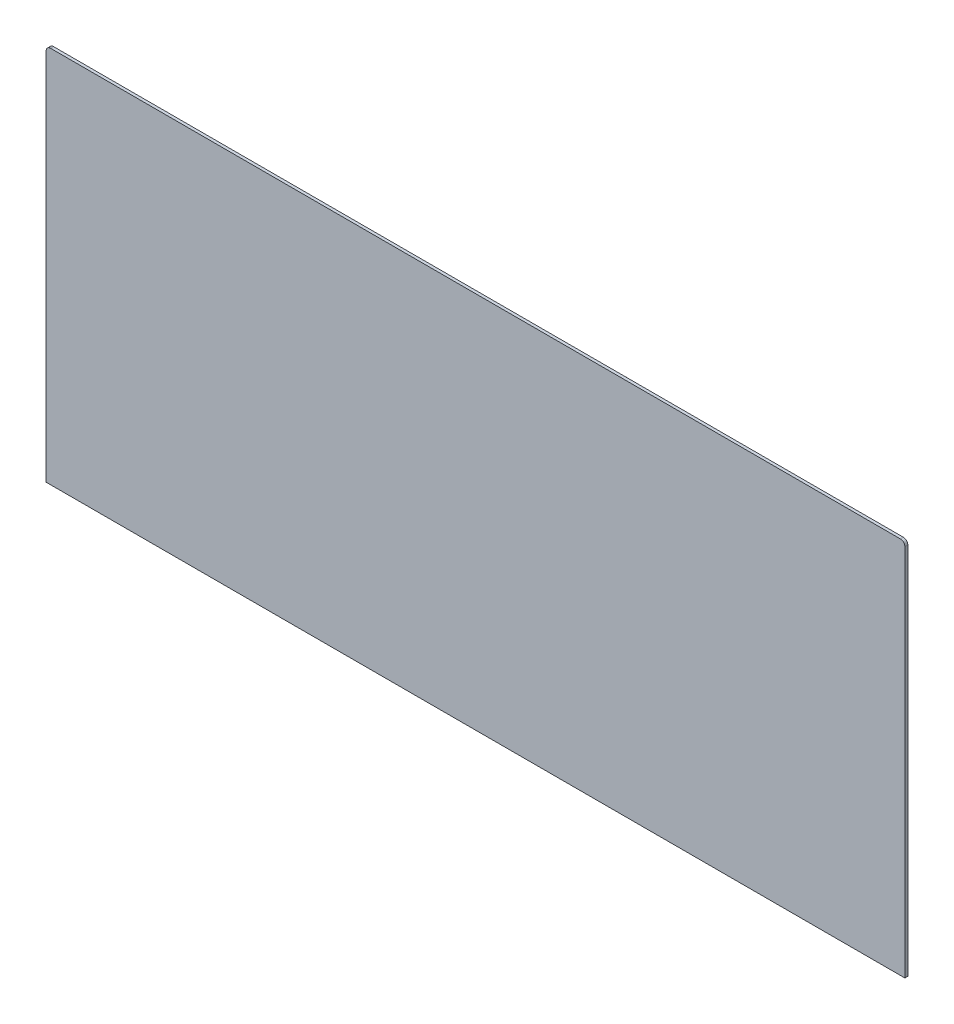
ISO-10303-21;
HEADER;
FILE_DESCRIPTION(('STEP AP214'),'2;1');
FILE_NAME('part.step','',(''),(''),'','','');
FILE_SCHEMA(('AUTOMOTIVE_DESIGN { 1 0 10303 214 1 1 1 1 }'));
ENDSEC;
DATA;
#1=APPLICATION_CONTEXT('core data for automotive mechanical design processes');
#2=APPLICATION_PROTOCOL_DEFINITION('international standard','automotive_design',2000,#1);
#3=PRODUCT_CONTEXT('',#1,'mechanical');
#4=PRODUCT('Part','Part','',(#3));
#5=PRODUCT_RELATED_PRODUCT_CATEGORY('part','',(#4));
#6=PRODUCT_DEFINITION_FORMATION('','',#4);
#7=PRODUCT_DEFINITION_CONTEXT('part definition',#1,'design');
#8=PRODUCT_DEFINITION('design','',#6,#7);
#9=PRODUCT_DEFINITION_SHAPE('','',#8);
#10=(LENGTH_UNIT() NAMED_UNIT(*) SI_UNIT(.MILLI.,.METRE.));
#11=(NAMED_UNIT(*) PLANE_ANGLE_UNIT() SI_UNIT($,.RADIAN.));
#12=(NAMED_UNIT(*) SI_UNIT($,.STERADIAN.) SOLID_ANGLE_UNIT());
#13=UNCERTAINTY_MEASURE_WITH_UNIT(LENGTH_MEASURE(1.E-05),#10,'distance_accuracy_value','');
#14=(GEOMETRIC_REPRESENTATION_CONTEXT(3) GLOBAL_UNCERTAINTY_ASSIGNED_CONTEXT((#13)) GLOBAL_UNIT_ASSIGNED_CONTEXT((#10,
#11,#12)) REPRESENTATION_CONTEXT('',''));
#15=CARTESIAN_POINT('',(0.,0.,0.));
#16=DIRECTION('',(0.,0.,1.));
#17=DIRECTION('',(1.,0.,0.));
#18=AXIS2_PLACEMENT_3D('',#15,#16,#17);
#19=CARTESIAN_POINT('',(0.,128.79374203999,2.));
#20=DIRECTION('',(0.,0.,1.));
#21=DIRECTION('',(1.,0.,0.));
#22=AXIS2_PLACEMENT_3D('',#19,#20,#21);
#23=PLANE('',#22);
#24=DIRECTION('',(1.,0.,0.));
#25=VECTOR('',#24,1.);
#26=CARTESIAN_POINT('',(-293.,0.,2.));
#27=LINE('',#26,#25);
#28=CARTESIAN_POINT('',(-293.,0.,2.));
#29=VERTEX_POINT('',#28);
#30=CARTESIAN_POINT('',(293.,0.,2.));
#31=VERTEX_POINT('',#30);
#32=EDGE_CURVE('E138',#29,#31,#27,.T.);
#33=ORIENTED_EDGE('',*,*,#32,.T.);
#34=DIRECTION('',(0.,1.,0.));
#35=VECTOR('',#34,1.);
#36=CARTESIAN_POINT('',(293.,0.,2.));
#37=LINE('',#36,#35);
#38=CARTESIAN_POINT('',(293.,255.,2.));
#39=VERTEX_POINT('',#38);
#40=EDGE_CURVE('E113',#31,#39,#37,.T.);
#41=ORIENTED_EDGE('',*,*,#40,.T.);
#42=CARTESIAN_POINT('',(290.,255.,2.));
#43=DIRECTION('',(0.,0.,1.));
#44=DIRECTION('',(1.,0.,0.));
#45=AXIS2_PLACEMENT_3D('',#42,#43,#44);
#46=CIRCLE('',#45,3.);
#47=CARTESIAN_POINT('',(290.,258.,2.));
#48=VERTEX_POINT('',#47);
#49=EDGE_CURVE('E103',#39,#48,#46,.T.);
#50=ORIENTED_EDGE('',*,*,#49,.T.);
#51=DIRECTION('',(-1.,0.,0.));
#52=VECTOR('',#51,1.);
#53=CARTESIAN_POINT('',(290.,258.,2.));
#54=LINE('',#53,#52);
#55=CARTESIAN_POINT('',(-290.,258.,2.));
#56=VERTEX_POINT('',#55);
#57=EDGE_CURVE('E88',#48,#56,#54,.T.);
#58=ORIENTED_EDGE('',*,*,#57,.T.);
#59=CARTESIAN_POINT('',(-290.,255.,2.));
#60=DIRECTION('',(0.,0.,1.));
#61=DIRECTION('',(1.,0.,0.));
#62=AXIS2_PLACEMENT_3D('',#59,#60,#61);
#63=CIRCLE('',#62,3.);
#64=CARTESIAN_POINT('',(-293.,255.,2.));
#65=VERTEX_POINT('',#64);
#66=EDGE_CURVE('E93',#56,#65,#63,.T.);
#67=ORIENTED_EDGE('',*,*,#66,.T.);
#68=DIRECTION('',(0.,-1.,0.));
#69=VECTOR('',#68,1.);
#70=CARTESIAN_POINT('',(-293.,255.,2.));
#71=LINE('',#70,#69);
#72=EDGE_CURVE('E10',#65,#29,#71,.T.);
#73=ORIENTED_EDGE('',*,*,#72,.T.);
#74=EDGE_LOOP('',(#33,#41,#50,#58,#67,#73));
#75=FACE_BOUND('',#74,.T.);
#76=ADVANCED_FACE('F16',(#75),#23,.T.);
#77=CARTESIAN_POINT('',(0.,128.79374203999,0.));
#78=DIRECTION('',(0.,0.,1.));
#79=DIRECTION('',(1.,0.,0.));
#80=AXIS2_PLACEMENT_3D('',#77,#78,#79);
#81=PLANE('',#80);
#82=DIRECTION('',(0.,-1.,0.));
#83=VECTOR('',#82,1.);
#84=CARTESIAN_POINT('',(-293.,255.,0.));
#85=LINE('',#84,#83);
#86=CARTESIAN_POINT('',(-293.,255.,0.));
#87=VERTEX_POINT('',#86);
#88=CARTESIAN_POINT('',(-293.,0.,0.));
#89=VERTEX_POINT('',#88);
#90=EDGE_CURVE('E24',#87,#89,#85,.T.);
#91=ORIENTED_EDGE('',*,*,#90,.F.);
#92=CARTESIAN_POINT('',(-290.,255.,0.));
#93=DIRECTION('',(0.,0.,1.));
#94=DIRECTION('',(1.,0.,0.));
#95=AXIS2_PLACEMENT_3D('',#92,#93,#94);
#96=CIRCLE('',#95,3.);
#97=CARTESIAN_POINT('',(-290.,258.,0.));
#98=VERTEX_POINT('',#97);
#99=EDGE_CURVE('E78',#98,#87,#96,.T.);
#100=ORIENTED_EDGE('',*,*,#99,.F.);
#101=DIRECTION('',(-1.,0.,0.));
#102=VECTOR('',#101,1.);
#103=CARTESIAN_POINT('',(290.,258.,0.));
#104=LINE('',#103,#102);
#105=CARTESIAN_POINT('',(290.,258.,0.));
#106=VERTEX_POINT('',#105);
#107=EDGE_CURVE('E82',#106,#98,#104,.T.);
#108=ORIENTED_EDGE('',*,*,#107,.F.);
#109=CARTESIAN_POINT('',(290.,255.,0.));
#110=DIRECTION('',(0.,0.,1.));
#111=DIRECTION('',(1.,0.,0.));
#112=AXIS2_PLACEMENT_3D('',#109,#110,#111);
#113=CIRCLE('',#112,3.);
#114=CARTESIAN_POINT('',(293.,255.,0.));
#115=VERTEX_POINT('',#114);
#116=EDGE_CURVE('E115',#115,#106,#113,.T.);
#117=ORIENTED_EDGE('',*,*,#116,.F.);
#118=DIRECTION('',(0.,1.,0.));
#119=VECTOR('',#118,1.);
#120=CARTESIAN_POINT('',(293.,0.,0.));
#121=LINE('',#120,#119);
#122=CARTESIAN_POINT('',(293.,0.,0.));
#123=VERTEX_POINT('',#122);
#124=EDGE_CURVE('E140',#123,#115,#121,.T.);
#125=ORIENTED_EDGE('',*,*,#124,.F.);
#126=DIRECTION('',(1.,0.,0.));
#127=VECTOR('',#126,1.);
#128=CARTESIAN_POINT('',(-293.,0.,0.));
#129=LINE('',#128,#127);
#130=EDGE_CURVE('E136',#89,#123,#129,.T.);
#131=ORIENTED_EDGE('',*,*,#130,.F.);
#132=EDGE_LOOP('',(#91,#100,#108,#117,#125,#131));
#133=FACE_BOUND('',#132,.T.);
#134=ADVANCED_FACE('F80',(#133),#81,.F.);
#135=CARTESIAN_POINT('',(-293.,255.,0.));
#136=DIRECTION('',(1.,0.,0.));
#137=DIRECTION('',(0.,1.,0.));
#138=AXIS2_PLACEMENT_3D('',#135,#136,#137);
#139=PLANE('',#138);
#140=ORIENTED_EDGE('',*,*,#90,.T.);
#141=DIRECTION('',(0.,0.,1.));
#142=VECTOR('',#141,1.);
#143=CARTESIAN_POINT('',(-293.,0.,0.));
#144=LINE('',#143,#142);
#145=EDGE_CURVE('E127',#89,#29,#144,.T.);
#146=ORIENTED_EDGE('',*,*,#145,.T.);
#147=ORIENTED_EDGE('',*,*,#72,.F.);
#148=DIRECTION('',(0.,0.,1.));
#149=VECTOR('',#148,1.);
#150=CARTESIAN_POINT('',(-293.,255.,0.));
#151=LINE('',#150,#149);
#152=EDGE_CURVE('E87',#87,#65,#151,.T.);
#153=ORIENTED_EDGE('',*,*,#152,.F.);
#154=EDGE_LOOP('',(#140,#146,#147,#153));
#155=FACE_BOUND('',#154,.T.);
#156=ADVANCED_FACE('F124',(#155),#139,.F.);
#157=CARTESIAN_POINT('',(-290.,255.,0.));
#158=DIRECTION('',(0.,0.,-1.));
#159=DIRECTION('',(1.,0.,0.));
#160=AXIS2_PLACEMENT_3D('',#157,#158,#159);
#161=CYLINDRICAL_SURFACE('',#160,3.);
#162=ORIENTED_EDGE('',*,*,#99,.T.);
#163=ORIENTED_EDGE('',*,*,#152,.T.);
#164=ORIENTED_EDGE('',*,*,#66,.F.);
#165=DIRECTION('',(0.,0.,1.));
#166=VECTOR('',#165,1.);
#167=CARTESIAN_POINT('',(-290.,258.,0.));
#168=LINE('',#167,#166);
#169=EDGE_CURVE('E91',#98,#56,#168,.T.);
#170=ORIENTED_EDGE('',*,*,#169,.F.);
#171=EDGE_LOOP('',(#162,#163,#164,#170));
#172=FACE_BOUND('',#171,.T.);
#173=ADVANCED_FACE('F92',(#172),#161,.T.);
#174=CARTESIAN_POINT('',(290.,258.,0.));
#175=DIRECTION('',(0.,-1.,0.));
#176=DIRECTION('',(0.,0.,-1.));
#177=AXIS2_PLACEMENT_3D('',#174,#175,#176);
#178=PLANE('',#177);
#179=ORIENTED_EDGE('',*,*,#107,.T.);
#180=ORIENTED_EDGE('',*,*,#169,.T.);
#181=ORIENTED_EDGE('',*,*,#57,.F.);
#182=DIRECTION('',(0.,0.,1.));
#183=VECTOR('',#182,1.);
#184=CARTESIAN_POINT('',(290.,258.,0.));
#185=LINE('',#184,#183);
#186=EDGE_CURVE('E100',#106,#48,#185,.T.);
#187=ORIENTED_EDGE('',*,*,#186,.F.);
#188=EDGE_LOOP('',(#179,#180,#181,#187));
#189=FACE_BOUND('',#188,.T.);
#190=ADVANCED_FACE('F98',(#189),#178,.F.);
#191=CARTESIAN_POINT('',(290.,255.,0.));
#192=DIRECTION('',(0.,0.,-1.));
#193=DIRECTION('',(1.,0.,0.));
#194=AXIS2_PLACEMENT_3D('',#191,#192,#193);
#195=CYLINDRICAL_SURFACE('',#194,3.);
#196=ORIENTED_EDGE('',*,*,#116,.T.);
#197=ORIENTED_EDGE('',*,*,#186,.T.);
#198=ORIENTED_EDGE('',*,*,#49,.F.);
#199=DIRECTION('',(0.,0.,1.));
#200=VECTOR('',#199,1.);
#201=CARTESIAN_POINT('',(293.,255.,0.));
#202=LINE('',#201,#200);
#203=EDGE_CURVE('E155',#115,#39,#202,.T.);
#204=ORIENTED_EDGE('',*,*,#203,.F.);
#205=EDGE_LOOP('',(#196,#197,#198,#204));
#206=FACE_BOUND('',#205,.T.);
#207=ADVANCED_FACE('F201',(#206),#195,.T.);
#208=CARTESIAN_POINT('',(293.,0.,0.));
#209=DIRECTION('',(-1.,0.,0.));
#210=DIRECTION('',(0.,0.,1.));
#211=AXIS2_PLACEMENT_3D('',#208,#209,#210);
#212=PLANE('',#211);
#213=ORIENTED_EDGE('',*,*,#124,.T.);
#214=ORIENTED_EDGE('',*,*,#203,.T.);
#215=ORIENTED_EDGE('',*,*,#40,.F.);
#216=DIRECTION('',(0.,0.,1.));
#217=VECTOR('',#216,1.);
#218=CARTESIAN_POINT('',(293.,0.,0.));
#219=LINE('',#218,#217);
#220=EDGE_CURVE('E146',#123,#31,#219,.T.);
#221=ORIENTED_EDGE('',*,*,#220,.F.);
#222=EDGE_LOOP('',(#213,#214,#215,#221));
#223=FACE_BOUND('',#222,.T.);
#224=ADVANCED_FACE('F164',(#223),#212,.F.);
#225=CARTESIAN_POINT('',(-293.,0.,0.));
#226=DIRECTION('',(0.,1.,0.));
#227=DIRECTION('',(1.,0.,0.));
#228=AXIS2_PLACEMENT_3D('',#225,#226,#227);
#229=PLANE('',#228);
#230=ORIENTED_EDGE('',*,*,#130,.T.);
#231=ORIENTED_EDGE('',*,*,#220,.T.);
#232=ORIENTED_EDGE('',*,*,#32,.F.);
#233=ORIENTED_EDGE('',*,*,#145,.F.);
#234=EDGE_LOOP('',(#230,#231,#232,#233));
#235=FACE_BOUND('',#234,.T.);
#236=ADVANCED_FACE('F134',(#235),#229,.F.);
#237=CLOSED_SHELL('',(#76,#134,#156,#173,#190,#207,#224,#236));
#238=MANIFOLD_SOLID_BREP('B1',#237);
#239=ADVANCED_BREP_SHAPE_REPRESENTATION('',(#18,#238),#14);
#240=SHAPE_DEFINITION_REPRESENTATION(#9,#239);
ENDSEC;
END-ISO-10303-21;
